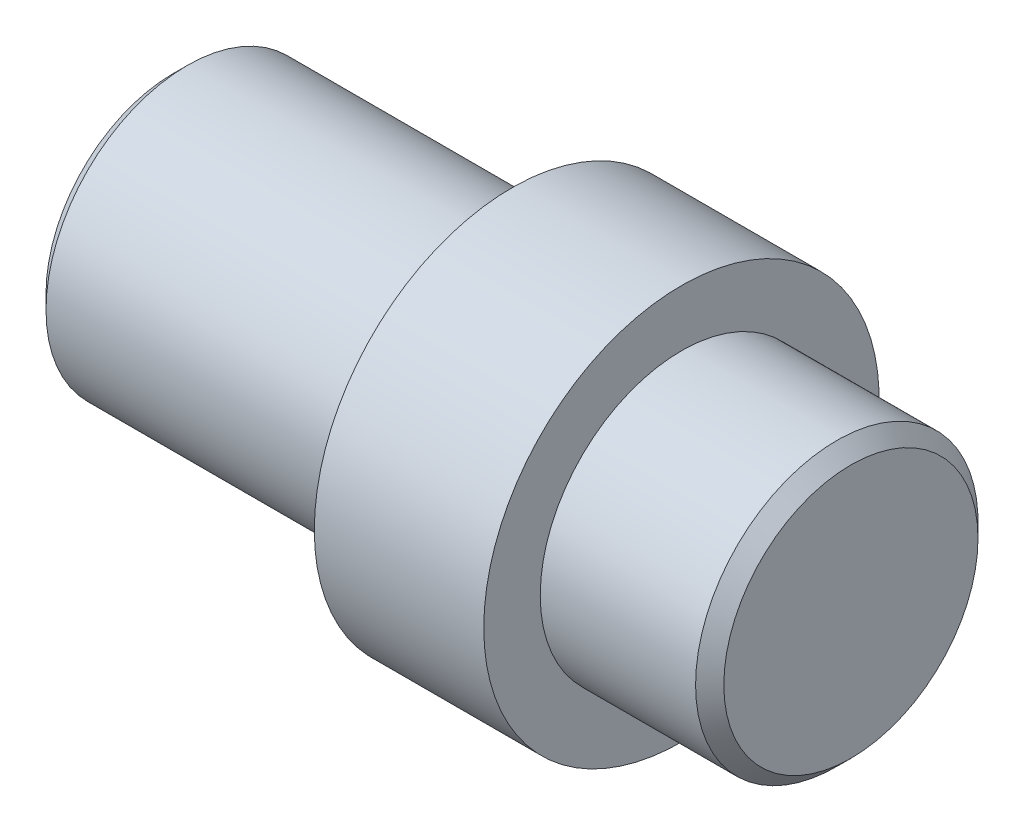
from build123d import *

# Parameters (mm, degrees)
CHANFREIN1_SIZE = 0.5


with BuildPart() as part:
    # Esquisse1 → Base-R_volution (revolve)
    with BuildSketch(Plane.XY, mode=Mode.PRIVATE) as base_r_volution_sk:
        Polygon((0, 0), (0, 5), (12, 5), (12, 7), (18, 7), (18, 5), (24, 5), (24, 0), align=None)
    revolve(base_r_volution_sk.sketch.rotate(Axis((0, 0, 0), (1, 0, 0)), 90), axis=Axis((0, 0, 0), (1, 0, 0)))

    # Chanfrein1
    chanfrein1_edges = [part.edges().sort_by_distance(p)[0] for p in [
        (0, 0, -5),
        (24, 0, -5),
    ]]
    chamfer(chanfrein1_edges, length=CHANFREIN1_SIZE)


solid = part.part
